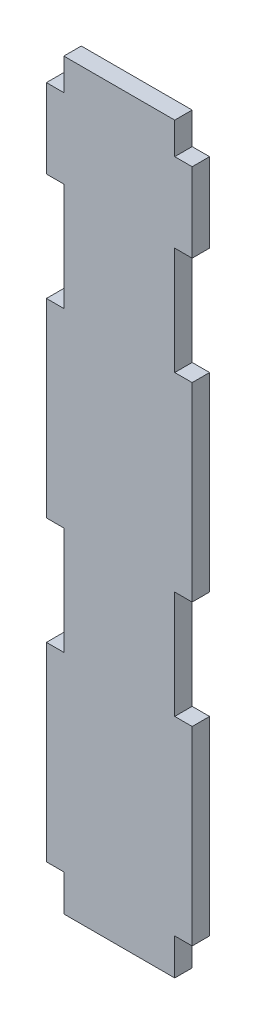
from build123d import *

# Parameters (mm, degrees)
BOSS_EXTRUDE1_DEPTH = 5.5


with BuildPart() as part:
    # Sketch1 → Boss-Extrude1 (new body)
    with BuildSketch(Plane.XY):
        Polygon((17.755173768, -117.377586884), (17.755173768, -105.877586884), (23.255173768, -105.877586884), (23.255173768, -45.877586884), (17.755173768, -45.877586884), (17.755173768, -11.877586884), (23.255173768, -11.877586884), (23.255173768, 48.122413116), (17.755173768, 48.122413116), (17.755173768, 82.122413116), (23.255173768, 82.122413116), (23.255173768, 107.122413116), (17.755173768, 107.122413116), (17.755173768, 117.122413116), (-17.244826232, 117.122413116), (-17.244826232, 107.122413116), (-22.744826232, 107.122413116), (-22.744826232, 82.122413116), (-17.244826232, 82.122413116), (-17.244826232, 48.122413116), (-22.744826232, 48.122413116), (-22.744826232, -11.877586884), (-17.244826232, -11.877586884), (-17.244826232, -45.877586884), (-22.744826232, -45.877586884), (-22.744826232, -105.877586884), (-17.244826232, -105.877586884), (-17.244826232, -117.377586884), align=None)
    extrude(amount=BOSS_EXTRUDE1_DEPTH)


solid = part.part
